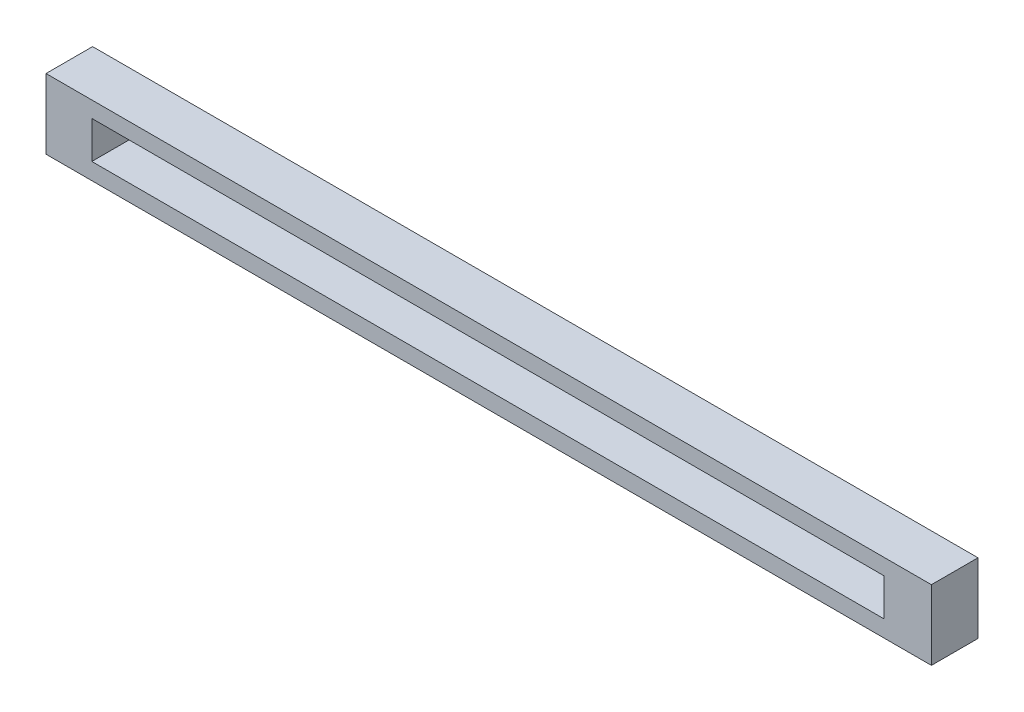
ISO-10303-21;
HEADER;
FILE_DESCRIPTION(('STEP AP214'),'2;1');
FILE_NAME('part.step','',(''),(''),'','','');
FILE_SCHEMA(('AUTOMOTIVE_DESIGN { 1 0 10303 214 1 1 1 1 }'));
ENDSEC;
DATA;
#1=APPLICATION_CONTEXT('core data for automotive mechanical design processes');
#2=APPLICATION_PROTOCOL_DEFINITION('international standard','automotive_design',2000,#1);
#3=PRODUCT_CONTEXT('',#1,'mechanical');
#4=PRODUCT('Part','Part','',(#3));
#5=PRODUCT_RELATED_PRODUCT_CATEGORY('part','',(#4));
#6=PRODUCT_DEFINITION_FORMATION('','',#4);
#7=PRODUCT_DEFINITION_CONTEXT('part definition',#1,'design');
#8=PRODUCT_DEFINITION('design','',#6,#7);
#9=PRODUCT_DEFINITION_SHAPE('','',#8);
#10=(LENGTH_UNIT() NAMED_UNIT(*) SI_UNIT(.MILLI.,.METRE.));
#11=(NAMED_UNIT(*) PLANE_ANGLE_UNIT() SI_UNIT($,.RADIAN.));
#12=(NAMED_UNIT(*) SI_UNIT($,.STERADIAN.) SOLID_ANGLE_UNIT());
#13=UNCERTAINTY_MEASURE_WITH_UNIT(LENGTH_MEASURE(1.E-05),#10,'distance_accuracy_value','');
#14=(GEOMETRIC_REPRESENTATION_CONTEXT(3) GLOBAL_UNCERTAINTY_ASSIGNED_CONTEXT((#13)) GLOBAL_UNIT_ASSIGNED_CONTEXT((#10,
#11,#12)) REPRESENTATION_CONTEXT('',''));
#15=CARTESIAN_POINT('',(0.,0.,0.));
#16=DIRECTION('',(0.,0.,1.));
#17=DIRECTION('',(1.,0.,0.));
#18=AXIS2_PLACEMENT_3D('',#15,#16,#17);
#19=CARTESIAN_POINT('',(482.510632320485,1.38777878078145E-13,-25.4));
#20=DIRECTION('',(1.,0.,0.));
#21=DIRECTION('',(0.,0.,-1.));
#22=AXIS2_PLACEMENT_3D('',#19,#20,#21);
#23=PLANE('',#22);
#24=DIRECTION('',(0.,1.,0.));
#25=VECTOR('',#24,1.);
#26=CARTESIAN_POINT('',(482.510632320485,1.38777878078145E-13,0.));
#27=LINE('',#26,#25);
#28=CARTESIAN_POINT('',(482.510632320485,1.38777878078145E-13,0.));
#29=VERTEX_POINT('',#28);
#30=CARTESIAN_POINT('',(482.510632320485,38.1000000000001,0.));
#31=VERTEX_POINT('',#30);
#32=EDGE_CURVE('E447',#29,#31,#27,.T.);
#33=ORIENTED_EDGE('',*,*,#32,.F.);
#34=DIRECTION('',(0.,0.,1.));
#35=VECTOR('',#34,1.);
#36=CARTESIAN_POINT('',(482.510632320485,1.38777878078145E-13,-25.4));
#37=LINE('',#36,#35);
#38=CARTESIAN_POINT('',(482.510632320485,1.38777878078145E-13,-25.4));
#39=VERTEX_POINT('',#38);
#40=EDGE_CURVE('E11',#39,#29,#37,.T.);
#41=ORIENTED_EDGE('',*,*,#40,.F.);
#42=DIRECTION('',(0.,1.,0.));
#43=VECTOR('',#42,1.);
#44=CARTESIAN_POINT('',(482.510632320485,1.38777878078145E-13,-25.4));
#45=LINE('',#44,#43);
#46=CARTESIAN_POINT('',(482.510632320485,38.1000000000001,-25.4));
#47=VERTEX_POINT('',#46);
#48=EDGE_CURVE('E461',#39,#47,#45,.T.);
#49=ORIENTED_EDGE('',*,*,#48,.T.);
#50=DIRECTION('',(0.,0.,1.));
#51=VECTOR('',#50,1.);
#52=CARTESIAN_POINT('',(482.510632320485,38.1000000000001,-25.4));
#53=LINE('',#52,#51);
#54=EDGE_CURVE('E351',#47,#31,#53,.T.);
#55=ORIENTED_EDGE('',*,*,#54,.T.);
#56=EDGE_LOOP('',(#33,#41,#49,#55));
#57=FACE_BOUND('',#56,.T.);
#58=ADVANCED_FACE('F348',(#57),#23,.T.);
#59=CARTESIAN_POINT('',(482.510632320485,1.38777878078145E-13,-25.4));
#60=DIRECTION('',(0.,-1.,0.));
#61=DIRECTION('',(1.,0.,0.));
#62=AXIS2_PLACEMENT_3D('',#59,#60,#61);
#63=PLANE('',#62);
#64=DIRECTION('',(1.,0.,0.));
#65=VECTOR('',#64,1.);
#66=CARTESIAN_POINT('',(482.510632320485,1.38777878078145E-13,0.));
#67=LINE('',#66,#65);
#68=CARTESIAN_POINT('',(0.,0.,0.));
#69=VERTEX_POINT('',#68);
#70=EDGE_CURVE('E458',#69,#29,#67,.T.);
#71=ORIENTED_EDGE('',*,*,#70,.F.);
#72=DIRECTION('',(0.,0.,1.));
#73=VECTOR('',#72,1.);
#74=CARTESIAN_POINT('',(0.,0.,-25.4));
#75=LINE('',#74,#73);
#76=CARTESIAN_POINT('',(0.,0.,-25.4));
#77=VERTEX_POINT('',#76);
#78=EDGE_CURVE('E356',#77,#69,#75,.T.);
#79=ORIENTED_EDGE('',*,*,#78,.F.);
#80=DIRECTION('',(1.,0.,0.));
#81=VECTOR('',#80,1.);
#82=CARTESIAN_POINT('',(0.,0.,-25.4));
#83=LINE('',#82,#81);
#84=EDGE_CURVE('E469',#77,#39,#83,.T.);
#85=ORIENTED_EDGE('',*,*,#84,.T.);
#86=ORIENTED_EDGE('',*,*,#40,.T.);
#87=EDGE_LOOP('',(#71,#79,#85,#86));
#88=FACE_BOUND('',#87,.T.);
#89=ADVANCED_FACE('F483',(#88),#63,.T.);
#90=CARTESIAN_POINT('',(0.,38.0999999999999,-25.4));
#91=DIRECTION('',(-1.,0.,0.));
#92=DIRECTION('',(0.,-1.,0.));
#93=AXIS2_PLACEMENT_3D('',#90,#91,#92);
#94=PLANE('',#93);
#95=DIRECTION('',(0.,-1.,0.));
#96=VECTOR('',#95,1.);
#97=CARTESIAN_POINT('',(0.,38.0999999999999,0.));
#98=LINE('',#97,#96);
#99=CARTESIAN_POINT('',(0.,38.0999999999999,0.));
#100=VERTEX_POINT('',#99);
#101=EDGE_CURVE('E455',#100,#69,#98,.T.);
#102=ORIENTED_EDGE('',*,*,#101,.F.);
#103=DIRECTION('',(0.,0.,1.));
#104=VECTOR('',#103,1.);
#105=CARTESIAN_POINT('',(0.,38.0999999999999,-25.4));
#106=LINE('',#105,#104);
#107=CARTESIAN_POINT('',(0.,38.0999999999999,-25.4));
#108=VERTEX_POINT('',#107);
#109=EDGE_CURVE('E472',#108,#100,#106,.T.);
#110=ORIENTED_EDGE('',*,*,#109,.F.);
#111=DIRECTION('',(0.,-1.,0.));
#112=VECTOR('',#111,1.);
#113=CARTESIAN_POINT('',(0.,38.0999999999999,-25.4));
#114=LINE('',#113,#112);
#115=EDGE_CURVE('E466',#108,#77,#114,.T.);
#116=ORIENTED_EDGE('',*,*,#115,.T.);
#117=ORIENTED_EDGE('',*,*,#78,.T.);
#118=EDGE_LOOP('',(#102,#110,#116,#117));
#119=FACE_BOUND('',#118,.T.);
#120=ADVANCED_FACE('F486',(#119),#94,.T.);
#121=CARTESIAN_POINT('',(5.04046692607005,38.1000000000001,-25.4));
#122=DIRECTION('',(0.,1.,0.));
#123=DIRECTION('',(-1.,0.,0.));
#124=AXIS2_PLACEMENT_3D('',#121,#122,#123);
#125=PLANE('',#124);
#126=DIRECTION('',(-1.,0.,0.));
#127=VECTOR('',#126,1.);
#128=CARTESIAN_POINT('',(5.04046692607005,38.1000000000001,0.));
#129=LINE('',#128,#127);
#130=EDGE_CURVE('E452',#31,#100,#129,.T.);
#131=ORIENTED_EDGE('',*,*,#130,.F.);
#132=ORIENTED_EDGE('',*,*,#54,.F.);
#133=DIRECTION('',(-1.,0.,0.));
#134=VECTOR('',#133,1.);
#135=CARTESIAN_POINT('',(482.510632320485,38.1000000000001,-25.4));
#136=LINE('',#135,#134);
#137=EDGE_CURVE('E464',#47,#108,#136,.T.);
#138=ORIENTED_EDGE('',*,*,#137,.T.);
#139=ORIENTED_EDGE('',*,*,#109,.T.);
#140=EDGE_LOOP('',(#131,#132,#138,#139));
#141=FACE_BOUND('',#140,.T.);
#142=ADVANCED_FACE('F490',(#141),#125,.T.);
#143=CARTESIAN_POINT('',(482.510632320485,38.1000000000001,-25.4));
#144=DIRECTION('',(0.,0.,1.));
#145=DIRECTION('',(1.,0.,0.));
#146=AXIS2_PLACEMENT_3D('',#143,#144,#145);
#147=PLANE('',#146);
#148=DIRECTION('',(1.,0.,0.));
#149=VECTOR('',#148,1.);
#150=CARTESIAN_POINT('',(456.763962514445,9.06559549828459,-25.4));
#151=LINE('',#150,#149);
#152=CARTESIAN_POINT('',(24.9639625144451,9.06559549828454,-25.4));
#153=VERTEX_POINT('',#152);
#154=CARTESIAN_POINT('',(456.763962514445,9.06559549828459,-25.4));
#155=VERTEX_POINT('',#154);
#156=EDGE_CURVE('E442',#153,#155,#151,.T.);
#157=ORIENTED_EDGE('',*,*,#156,.T.);
#158=DIRECTION('',(0.,1.,0.));
#159=VECTOR('',#158,1.);
#160=CARTESIAN_POINT('',(456.763962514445,29.3855954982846,-25.4));
#161=LINE('',#160,#159);
#162=CARTESIAN_POINT('',(456.763962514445,29.3855954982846,-25.4));
#163=VERTEX_POINT('',#162);
#164=EDGE_CURVE('E433',#155,#163,#161,.T.);
#165=ORIENTED_EDGE('',*,*,#164,.T.);
#166=DIRECTION('',(-1.,0.,0.));
#167=VECTOR('',#166,1.);
#168=CARTESIAN_POINT('',(456.763962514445,29.3855954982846,-25.4));
#169=LINE('',#168,#167);
#170=CARTESIAN_POINT('',(24.963962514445,29.3855954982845,-25.4));
#171=VERTEX_POINT('',#170);
#172=EDGE_CURVE('E439',#163,#171,#169,.T.);
#173=ORIENTED_EDGE('',*,*,#172,.T.);
#174=DIRECTION('',(0.,-1.,0.));
#175=VECTOR('',#174,1.);
#176=CARTESIAN_POINT('',(24.9639625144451,29.3855954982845,-25.4));
#177=LINE('',#176,#175);
#178=EDGE_CURVE('E364',#171,#153,#177,.T.);
#179=ORIENTED_EDGE('',*,*,#178,.T.);
#180=EDGE_LOOP('',(#157,#165,#173,#179));
#181=FACE_BOUND('',#180,.T.);
#182=ORIENTED_EDGE('',*,*,#48,.F.);
#183=ORIENTED_EDGE('',*,*,#84,.F.);
#184=ORIENTED_EDGE('',*,*,#115,.F.);
#185=ORIENTED_EDGE('',*,*,#137,.F.);
#186=EDGE_LOOP('',(#182,#183,#184,#185));
#187=FACE_BOUND('',#186,.T.);
#188=ADVANCED_FACE('F489',(#181,#187),#147,.F.);
#189=CARTESIAN_POINT('',(482.510632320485,38.1000000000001,0.));
#190=DIRECTION('',(0.,0.,1.));
#191=DIRECTION('',(1.,0.,0.));
#192=AXIS2_PLACEMENT_3D('',#189,#190,#191);
#193=PLANE('',#192);
#194=DIRECTION('',(0.,1.,0.));
#195=VECTOR('',#194,1.);
#196=CARTESIAN_POINT('',(456.763962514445,29.3855954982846,0.));
#197=LINE('',#196,#195);
#198=CARTESIAN_POINT('',(456.763962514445,9.06559549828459,0.));
#199=VERTEX_POINT('',#198);
#200=CARTESIAN_POINT('',(456.763962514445,29.3855954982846,0.));
#201=VERTEX_POINT('',#200);
#202=EDGE_CURVE('E372',#199,#201,#197,.T.);
#203=ORIENTED_EDGE('',*,*,#202,.F.);
#204=DIRECTION('',(1.,0.,0.));
#205=VECTOR('',#204,1.);
#206=CARTESIAN_POINT('',(456.763962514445,9.06559549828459,0.));
#207=LINE('',#206,#205);
#208=CARTESIAN_POINT('',(24.9639625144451,9.06559549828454,0.));
#209=VERTEX_POINT('',#208);
#210=EDGE_CURVE('E431',#209,#199,#207,.T.);
#211=ORIENTED_EDGE('',*,*,#210,.F.);
#212=DIRECTION('',(0.,-1.,0.));
#213=VECTOR('',#212,1.);
#214=CARTESIAN_POINT('',(24.9639625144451,29.3855954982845,0.));
#215=LINE('',#214,#213);
#216=CARTESIAN_POINT('',(24.9639625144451,29.3855954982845,0.));
#217=VERTEX_POINT('',#216);
#218=EDGE_CURVE('E415',#217,#209,#215,.T.);
#219=ORIENTED_EDGE('',*,*,#218,.F.);
#220=DIRECTION('',(-1.,0.,0.));
#221=VECTOR('',#220,1.);
#222=CARTESIAN_POINT('',(456.763962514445,29.3855954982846,0.));
#223=LINE('',#222,#221);
#224=EDGE_CURVE('E424',#201,#217,#223,.T.);
#225=ORIENTED_EDGE('',*,*,#224,.F.);
#226=EDGE_LOOP('',(#203,#211,#219,#225));
#227=FACE_BOUND('',#226,.T.);
#228=ORIENTED_EDGE('',*,*,#32,.T.);
#229=ORIENTED_EDGE('',*,*,#130,.T.);
#230=ORIENTED_EDGE('',*,*,#101,.T.);
#231=ORIENTED_EDGE('',*,*,#70,.T.);
#232=EDGE_LOOP('',(#228,#229,#230,#231));
#233=FACE_BOUND('',#232,.T.);
#234=ADVANCED_FACE('F428',(#227,#233),#193,.T.);
#235=CARTESIAN_POINT('',(456.763962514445,29.3855954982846,-25.4));
#236=DIRECTION('',(1.,0.,0.));
#237=DIRECTION('',(0.,0.,-1.));
#238=AXIS2_PLACEMENT_3D('',#235,#236,#237);
#239=PLANE('',#238);
#240=ORIENTED_EDGE('',*,*,#202,.T.);
#241=DIRECTION('',(0.,0.,1.));
#242=VECTOR('',#241,1.);
#243=CARTESIAN_POINT('',(456.763962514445,29.3855954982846,-25.4));
#244=LINE('',#243,#242);
#245=EDGE_CURVE('E421',#163,#201,#244,.T.);
#246=ORIENTED_EDGE('',*,*,#245,.F.);
#247=ORIENTED_EDGE('',*,*,#164,.F.);
#248=DIRECTION('',(0.,0.,1.));
#249=VECTOR('',#248,1.);
#250=CARTESIAN_POINT('',(456.763962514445,9.06559549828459,-25.4));
#251=LINE('',#250,#249);
#252=EDGE_CURVE('E445',#155,#199,#251,.T.);
#253=ORIENTED_EDGE('',*,*,#252,.T.);
#254=EDGE_LOOP('',(#240,#246,#247,#253));
#255=FACE_BOUND('',#254,.T.);
#256=ADVANCED_FACE('F509',(#255),#239,.F.);
#257=CARTESIAN_POINT('',(456.763962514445,9.06559549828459,-25.4));
#258=DIRECTION('',(0.,-1.,0.));
#259=DIRECTION('',(1.,0.,0.));
#260=AXIS2_PLACEMENT_3D('',#257,#258,#259);
#261=PLANE('',#260);
#262=ORIENTED_EDGE('',*,*,#210,.T.);
#263=ORIENTED_EDGE('',*,*,#252,.F.);
#264=ORIENTED_EDGE('',*,*,#156,.F.);
#265=DIRECTION('',(0.,0.,1.));
#266=VECTOR('',#265,1.);
#267=CARTESIAN_POINT('',(24.9639625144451,9.06559549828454,-25.4));
#268=LINE('',#267,#266);
#269=EDGE_CURVE('E420',#153,#209,#268,.T.);
#270=ORIENTED_EDGE('',*,*,#269,.T.);
#271=EDGE_LOOP('',(#262,#263,#264,#270));
#272=FACE_BOUND('',#271,.T.);
#273=ADVANCED_FACE('F512',(#272),#261,.F.);
#274=CARTESIAN_POINT('',(24.9639625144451,29.3855954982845,-25.4));
#275=DIRECTION('',(-1.,0.,0.));
#276=DIRECTION('',(0.,-1.,0.));
#277=AXIS2_PLACEMENT_3D('',#274,#275,#276);
#278=PLANE('',#277);
#279=ORIENTED_EDGE('',*,*,#218,.T.);
#280=ORIENTED_EDGE('',*,*,#269,.F.);
#281=ORIENTED_EDGE('',*,*,#178,.F.);
#282=DIRECTION('',(0.,0.,1.));
#283=VECTOR('',#282,1.);
#284=CARTESIAN_POINT('',(24.9639625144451,29.3855954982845,-25.4));
#285=LINE('',#284,#283);
#286=EDGE_CURVE('E411',#171,#217,#285,.T.);
#287=ORIENTED_EDGE('',*,*,#286,.T.);
#288=EDGE_LOOP('',(#279,#280,#281,#287));
#289=FACE_BOUND('',#288,.T.);
#290=ADVANCED_FACE('F413',(#289),#278,.F.);
#291=CARTESIAN_POINT('',(456.763962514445,29.3855954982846,-25.4));
#292=DIRECTION('',(0.,1.,0.));
#293=DIRECTION('',(-1.,0.,0.));
#294=AXIS2_PLACEMENT_3D('',#291,#292,#293);
#295=PLANE('',#294);
#296=ORIENTED_EDGE('',*,*,#224,.T.);
#297=ORIENTED_EDGE('',*,*,#286,.F.);
#298=ORIENTED_EDGE('',*,*,#172,.F.);
#299=ORIENTED_EDGE('',*,*,#245,.T.);
#300=EDGE_LOOP('',(#296,#297,#298,#299));
#301=FACE_BOUND('',#300,.T.);
#302=ADVANCED_FACE('F425',(#301),#295,.F.);
#303=CLOSED_SHELL('',(#58,#89,#120,#142,#188,#234,#256,#273,#290,#302));
#304=MANIFOLD_SOLID_BREP('B2',#303);
#305=ADVANCED_BREP_SHAPE_REPRESENTATION('',(#18,#304),#14);
#306=SHAPE_DEFINITION_REPRESENTATION(#9,#305);
ENDSEC;
END-ISO-10303-21;
